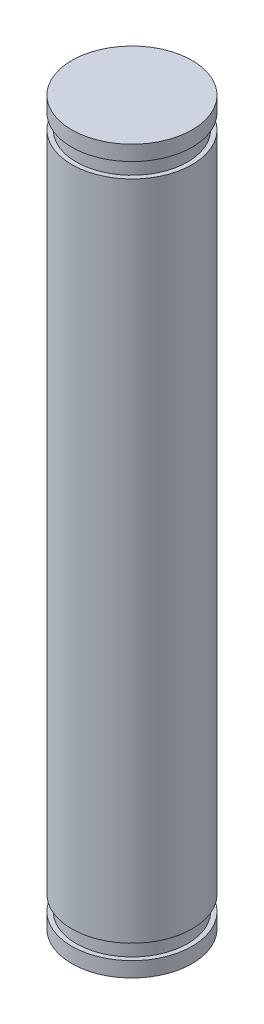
from build123d import *

# Parameters (mm, degrees)
SKETCH_1_R      = 4
EXTRUDE_1_DEPTH = 1
SKETCH_2_R      = 3.7
EXTRUDE_2_DEPTH = 1
SKETCH_3_R      = 4
EXTRUDE_3_DEPTH = 44
SKETCH_4_R      = 3.7
EXTRUDE_4_DEPTH = 1
SKETCH_5_R      = 4
EXTRUDE_5_DEPTH = 1


with BuildPart() as part:
    # Sketch 1 → Extrude 1 (new body)
    with BuildSketch(Plane(origin=(0, 0, 0), x_dir=(1, 0, 0), z_dir=(0, 1, 0))):
        with Locations(Location((0, 0, 0), (0, 0, 270))):
            Circle(SKETCH_1_R)
    extrude(amount=EXTRUDE_1_DEPTH)

    # Sketch 2 → Extrude 2 (add)
    with BuildSketch(Plane(origin=(0, 1, 0), x_dir=(1, 0, 0), z_dir=(0, 1, 0))):
        with Locations(Location((0, 0, 0), (0, 0, 270))):
            Circle(SKETCH_2_R)
    extrude(amount=EXTRUDE_2_DEPTH)

    # Sketch 3 → Extrude 3 (add)
    with BuildSketch(Plane(origin=(0, 2, 0), x_dir=(1, 0, 0), z_dir=(0, 1, 0))):
        with Locations(Location((0, 0, 0), (0, 0, 270))):
            Circle(SKETCH_3_R)
    extrude(amount=EXTRUDE_3_DEPTH)

    # Sketch 4 → Extrude 4 (add)
    with BuildSketch(Plane(origin=(0, 46, 0), x_dir=(1, 0, 0), z_dir=(0, 1, 0))):
        with Locations(Location((0, 0, 0), (0, 0, 270))):
            Circle(SKETCH_4_R)
    extrude(amount=EXTRUDE_4_DEPTH)

    # Sketch 5 → Extrude 5 (add)
    with BuildSketch(Plane(origin=(0, 47, 0), x_dir=(1, 0, 0), z_dir=(0, 1, 0))):
        with Locations(Location((0, 0, 0), (0, 0, 270))):
            Circle(SKETCH_5_R)
    extrude(amount=EXTRUDE_5_DEPTH)


solid = part.part
